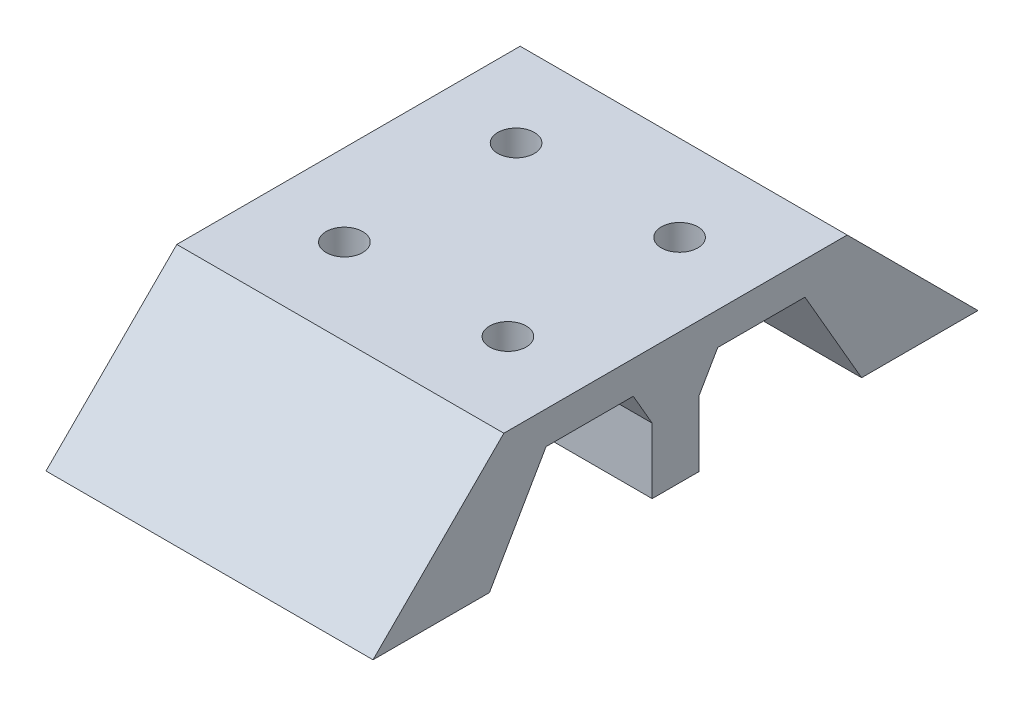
from build123d import *
from OCP.BRepFilletAPI import BRepFilletAPI_MakeChamfer

# Parameters (mm, degrees)
BODY_DEPTH                     = 38.1
F_7_0_201_DIAMETER_HOLE1_D     = 5.1054
F_7_0_201_DIAMETER_HOLE1_DEPTH = 3.556
F_7_0_201_DIAMETER_HOLE1_TIP   = 1.533816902
CHAMFER1_SIZE                  = 0.635
CHAMFER1_SIZE2                 = 0.366617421


with BuildPart() as part:
    # Profile → Body (new body)
    with BuildSketch(Plane(origin=(0, 0, 0), x_dir=(0, 0, -1), z_dir=(1, 0, 0))):
        Polygon((20, 1.905), (-20, 1.905), (-23.81, -1.905), (-27.62, -5.715), (-35.24, -13.335), (-21.679113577, -13.335), (-17.279704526, -5.715), (-15.08, -1.905), (-14.6, -1.905), (-5.4, -1.905), (-4.92, -1.905), (-2.720295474, -5.715), (-2.720295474, -13.335), (2.720295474, -13.335), (2.720295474, -5.715), (4.92, -1.905), (5.4, -1.905), (14.6, -1.905), (15.08, -1.905), (17.279704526, -5.715), (21.679113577, -13.335), (35.24, -13.335), (27.62, -5.715), (23.81, -1.905), align=None)
    extrude(amount=BODY_DEPTH)

    # 7 _0.201_ Diameter Hole1
    with Locations(Plane(origin=(0, -1.905, 0), x_dir=(-1, 0, 0), z_dir=(0, -1, 0))):
        with Locations((-9.525, 10), (-9.525, -10), (-28.575, -10), (-28.575, 10)):
            Hole(F_7_0_201_DIAMETER_HOLE1_D / 2, depth=F_7_0_201_DIAMETER_HOLE1_DEPTH)
            with Locations((0, 0, -(F_7_0_201_DIAMETER_HOLE1_DEPTH + F_7_0_201_DIAMETER_HOLE1_TIP / 2))):  # 118° drill point
                Cone(0, F_7_0_201_DIAMETER_HOLE1_D / 2, F_7_0_201_DIAMETER_HOLE1_TIP, mode=Mode.SUBTRACT)

    # Chamfer1: one chamfer whose edges measure the first distance from different faces: ONE call of the kernel's chamfer builder (chamfer() names one face for all edges)
    chamfer1_edges_1 = [part.edges().sort_by_distance(p)[0] for p in [
        (26.0223, -1.905, -10),
        (6.9723, -1.905, -10),
    ]]
    chamfer1_side_1 = [part.faces().sort_by_distance(p)[0] for p in [
        (19.05, -1.905, -10),
    ]]
    chamfer1_edges_2 = [part.edges().sort_by_distance(p)[0] for p in [
        (26.0223, -1.905, 10),
        (6.9723, -1.905, 10),
    ]]
    chamfer1_side_2 = [part.faces().sort_by_distance(p)[0] for p in [
        (19.05, -1.905, 10),
    ]]
    chamfer1 = BRepFilletAPI_MakeChamfer(part.part.solid().wrapped)
    for e in chamfer1_edges_1:
        chamfer1.Add(CHAMFER1_SIZE, CHAMFER1_SIZE2, e.wrapped, chamfer1_side_1[0].wrapped)  # the first distance lies on this face
    for e in chamfer1_edges_2:
        chamfer1.Add(CHAMFER1_SIZE, CHAMFER1_SIZE2, e.wrapped, chamfer1_side_2[0].wrapped)  # the first distance lies on this face
    add(Compound.cast(chamfer1.Shape()), mode=Mode.REPLACE)


solid = part.part
